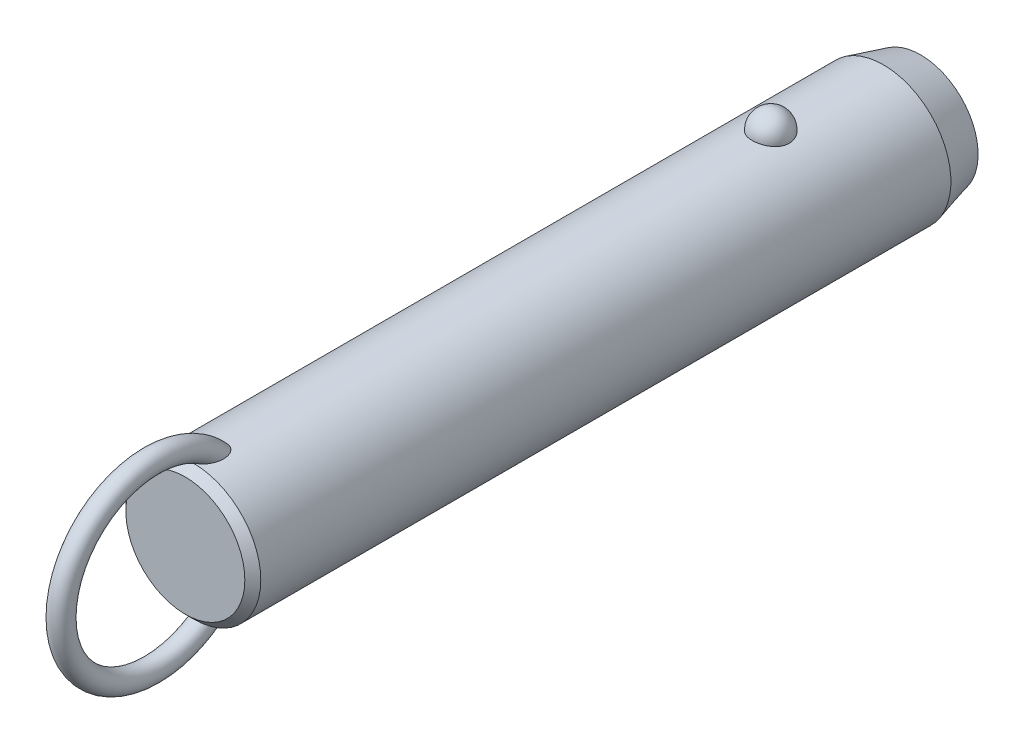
ISO-10303-21;
HEADER;
FILE_DESCRIPTION(('STEP AP214'),'2;1');
FILE_NAME('part.step','',(''),(''),'','','');
FILE_SCHEMA(('AUTOMOTIVE_DESIGN { 1 0 10303 214 1 1 1 1 }'));
ENDSEC;
DATA;
#1=APPLICATION_CONTEXT('core data for automotive mechanical design processes');
#2=APPLICATION_PROTOCOL_DEFINITION('international standard','automotive_design',2000,#1);
#3=PRODUCT_CONTEXT('',#1,'mechanical');
#4=PRODUCT('Part','Part','',(#3));
#5=PRODUCT_RELATED_PRODUCT_CATEGORY('part','',(#4));
#6=PRODUCT_DEFINITION_FORMATION('','',#4);
#7=PRODUCT_DEFINITION_CONTEXT('part definition',#1,'design');
#8=PRODUCT_DEFINITION('design','',#6,#7);
#9=PRODUCT_DEFINITION_SHAPE('','',#8);
#10=(LENGTH_UNIT() NAMED_UNIT(*) SI_UNIT(.MILLI.,.METRE.));
#11=(NAMED_UNIT(*) PLANE_ANGLE_UNIT() SI_UNIT($,.RADIAN.));
#12=(NAMED_UNIT(*) SI_UNIT($,.STERADIAN.) SOLID_ANGLE_UNIT());
#13=UNCERTAINTY_MEASURE_WITH_UNIT(LENGTH_MEASURE(1.E-05),#10,'distance_accuracy_value','');
#14=(GEOMETRIC_REPRESENTATION_CONTEXT(3) GLOBAL_UNCERTAINTY_ASSIGNED_CONTEXT((#13)) GLOBAL_UNIT_ASSIGNED_CONTEXT((#10,
#11,#12)) REPRESENTATION_CONTEXT('',''));
#15=CARTESIAN_POINT('',(0.,0.,0.));
#16=DIRECTION('',(0.,0.,1.));
#17=DIRECTION('',(1.,0.,0.));
#18=AXIS2_PLACEMENT_3D('',#15,#16,#17);
#19=CARTESIAN_POINT('',(0.,0.,94.));
#20=DIRECTION('',(0.,0.,-1.));
#21=DIRECTION('',(-1.,0.,0.));
#22=AXIS2_PLACEMENT_3D('',#19,#20,#21);
#23=CYLINDRICAL_SURFACE('',#22,12.7);
#24=CARTESIAN_POINT('',(3.46661256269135,12.2177165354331,-3.5));
#25=CARTESIAN_POINT('',(3.4666090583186,12.2177194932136,-3.30432790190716));
#26=CARTESIAN_POINT('',(3.45063567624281,12.2222841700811,-3.10861112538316));
#27=CARTESIAN_POINT('',(3.38712451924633,12.2400345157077,-2.72271899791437));
#28=CARTESIAN_POINT('',(3.33957415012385,12.2532236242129,-2.53254588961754));
#29=CARTESIAN_POINT('',(3.2141234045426,12.286724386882,-2.16324948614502));
#30=CARTESIAN_POINT('',(3.13623639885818,12.3070329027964,-1.98412136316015));
#31=CARTESIAN_POINT('',(2.95205930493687,12.3525018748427,-1.64180592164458));
#32=CARTESIAN_POINT('',(2.84577003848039,12.3776621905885,-1.47861814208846));
#33=CARTESIAN_POINT('',(2.60688050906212,12.4301712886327,-1.17190583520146));
#34=CARTESIAN_POINT('',(2.47415697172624,12.4575299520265,-1.02847897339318));
#35=CARTESIAN_POINT('',(2.18615174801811,12.5112810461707,-0.766177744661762));
#36=CARTESIAN_POINT('',(2.03087002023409,12.5376734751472,-0.64730342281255));
#37=CARTESIAN_POINT('',(1.70237334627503,12.5864761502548,-0.437732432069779));
#38=CARTESIAN_POINT('',(1.52920948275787,12.6088972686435,-0.346958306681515));
#39=CARTESIAN_POINT('',(1.16944170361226,12.6473352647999,-0.195750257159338));
#40=CARTESIAN_POINT('',(0.982839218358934,12.663352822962,-0.135313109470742));
#41=CARTESIAN_POINT('',(0.604961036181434,12.6869706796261,-0.0473241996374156));
#42=CARTESIAN_POINT('',(0.41382314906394,12.6947125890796,-0.0192185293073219));
#43=CARTESIAN_POINT('',(0.0293827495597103,12.7014203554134,0.0051725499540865));
#44=CARTESIAN_POINT('',(-0.163919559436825,12.7003870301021,0.00146092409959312));
#45=CARTESIAN_POINT('',(-0.544374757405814,12.689735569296,-0.0373939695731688));
#46=CARTESIAN_POINT('',(-0.731575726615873,12.6802364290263,-0.0721015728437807));
#47=CARTESIAN_POINT('',(-1.09733277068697,12.6538333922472,-0.171364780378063));
#48=CARTESIAN_POINT('',(-1.27588869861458,12.6369293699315,-0.235920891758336));
#49=CARTESIAN_POINT('',(-1.6204698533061,12.5973946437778,-0.393548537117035));
#50=CARTESIAN_POINT('',(-1.78641865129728,12.5747321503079,-0.486778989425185));
#51=CARTESIAN_POINT('',(-2.10030671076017,12.5261316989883,-0.699110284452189));
#52=CARTESIAN_POINT('',(-2.24824419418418,12.5001934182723,-0.818213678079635));
#53=CARTESIAN_POINT('',(-2.52491489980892,12.4472906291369,-1.08157124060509));
#54=CARTESIAN_POINT('',(-2.65324222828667,12.4203160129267,-1.22624992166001));
#55=CARTESIAN_POINT('',(-2.88410007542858,12.3687509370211,-1.53528325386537));
#56=CARTESIAN_POINT('',(-2.98662883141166,12.3441606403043,-1.69963924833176));
#57=CARTESIAN_POINT('',(-3.16432417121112,12.2998199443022,-2.04548497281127));
#58=CARTESIAN_POINT('',(-3.23917525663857,12.2801261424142,-2.22714424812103));
#59=CARTESIAN_POINT('',(-3.35800573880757,12.248167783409,-2.6009138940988));
#60=CARTESIAN_POINT('',(-3.4019860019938,12.2359030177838,-2.79302397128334));
#61=CARTESIAN_POINT('',(-3.45784812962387,12.2202347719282,-3.18140279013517));
#62=CARTESIAN_POINT('',(-3.46986123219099,12.2167950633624,-3.37765118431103));
#63=CARTESIAN_POINT('',(-3.46186273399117,12.2190638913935,-3.76943689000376));
#64=CARTESIAN_POINT('',(-3.44185196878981,12.2247721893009,-3.96497421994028));
#65=CARTESIAN_POINT('',(-3.37048652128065,12.2446381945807,-4.34881728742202));
#66=CARTESIAN_POINT('',(-3.31928253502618,12.2587552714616,-4.53715319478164));
#67=CARTESIAN_POINT('',(-3.18693461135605,12.2938237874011,-4.90231727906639));
#68=CARTESIAN_POINT('',(-3.1057895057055,12.3147754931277,-5.07914500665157));
#69=CARTESIAN_POINT('',(-2.91506431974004,12.3613125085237,-5.41732059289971));
#70=CARTESIAN_POINT('',(-2.80533587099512,12.3869217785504,-5.57858147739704));
#71=CARTESIAN_POINT('',(-2.560414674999,12.4398525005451,-5.88013283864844));
#72=CARTESIAN_POINT('',(-2.42522099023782,12.4671740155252,-6.02042254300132));
#73=CARTESIAN_POINT('',(-2.1323357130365,12.5205965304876,-6.27662798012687));
#74=CARTESIAN_POINT('',(-1.97456596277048,12.5466928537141,-6.3924554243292));
#75=CARTESIAN_POINT('',(-1.64115839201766,12.5946384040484,-6.59583547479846));
#76=CARTESIAN_POINT('',(-1.46552179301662,12.6164879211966,-6.68339001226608));
#77=CARTESIAN_POINT('',(-1.10356050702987,12.6532533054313,-6.82682153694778));
#78=CARTESIAN_POINT('',(-0.9173913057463,12.6682500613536,-6.8830698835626));
#79=CARTESIAN_POINT('',(-0.537836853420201,12.6900288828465,-6.96386887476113));
#80=CARTESIAN_POINT('',(-0.344452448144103,12.6968119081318,-6.9884232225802));
#81=CARTESIAN_POINT('',(0.0402577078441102,12.7013667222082,-7.00496469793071));
#82=CARTESIAN_POINT('',(0.231556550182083,12.6993008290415,-6.99753844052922));
#83=CARTESIAN_POINT('',(0.610105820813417,12.6867505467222,-6.9516636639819));
#84=CARTESIAN_POINT('',(0.797356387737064,12.6762664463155,-6.913216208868));
#85=CARTESIAN_POINT('',(1.16186657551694,12.6480587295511,-6.80658431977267));
#86=CARTESIAN_POINT('',(1.33915951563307,12.6303611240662,-6.73850666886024));
#87=CARTESIAN_POINT('',(1.67968518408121,12.5896027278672,-6.5745087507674));
#88=CARTESIAN_POINT('',(1.84291705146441,12.5665416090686,-6.47858678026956));
#89=CARTESIAN_POINT('',(2.15340192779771,12.5171072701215,-6.25982455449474));
#90=CARTESIAN_POINT('',(2.30037831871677,12.4906895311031,-6.13660186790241));
#91=CARTESIAN_POINT('',(2.5717412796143,12.4376567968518,-5.86739587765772));
#92=CARTESIAN_POINT('',(2.69612388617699,12.4110417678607,-5.72140858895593));
#93=CARTESIAN_POINT('',(2.92107785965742,12.360051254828,-5.40794137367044));
#94=CARTESIAN_POINT('',(3.02121329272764,12.3357209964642,-5.24014110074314));
#95=CARTESIAN_POINT('',(3.19236291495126,12.2925446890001,-4.88969865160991));
#96=CARTESIAN_POINT('',(3.26338839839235,12.2736965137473,-4.70706226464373));
#97=CARTESIAN_POINT('',(3.36788038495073,12.245404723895,-4.35469510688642));
#98=CARTESIAN_POINT('',(3.40484026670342,12.2351018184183,-4.18605935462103));
#99=CARTESIAN_POINT('',(3.45420764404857,12.2212564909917,-3.84496058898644));
#100=CARTESIAN_POINT('',(3.46661565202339,12.2177139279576,-3.67249765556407));
#101=CARTESIAN_POINT('',(3.46661256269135,12.2177165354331,-3.5));
#102=B_SPLINE_CURVE_WITH_KNOTS('',3,(#24,#25,#26,#27,#28,#29,#30,#31,#32,#33,#34,#35,#36,#37,
#38,#39,#40,#41,#42,#43,#44,#45,#46,#47,#48,#49,#50,#51,#52,#53,#54,#55,#56,#57,#58,#59,#60,#61,
#62,#63,#64,#65,#66,#67,#68,#69,#70,#71,#72,#73,#74,#75,#76,#77,#78,#79,#80,#81,#82,#83,#84,#85,
#86,#87,#88,#89,#90,#91,#92,#93,#94,#95,#96,#97,#98,#99,#100,#101),.UNSPECIFIED.,.T.,.F.,(4,2,2,
2,2,2,2,2,2,2,2,2,2,2,2,2,2,2,2,2,2,2,2,2,2,2,2,2,2,2,2,2,2,2,2,2,2,2,4),(0.,0.586396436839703,
1.17302689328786,1.7593990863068,2.34575431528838,2.93491084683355,3.52406845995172,
4.11158733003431,4.69904375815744,5.2762784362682,5.85345931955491,6.42265312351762,
6.99185659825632,7.56427334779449,8.136746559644,8.71981013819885,9.3029135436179,
9.89247258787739,10.4820150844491,11.0691335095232,11.6562366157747,12.2405256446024,
12.8248374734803,13.412244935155,13.9996740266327,14.5891883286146,15.1786623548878,
15.7609861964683,16.3432419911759,16.9148635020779,17.4864654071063,18.0560241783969,
18.6256177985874,19.2037609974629,19.7820055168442,20.3699810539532,20.957728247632,
21.4746855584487,21.9916320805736),.UNSPECIFIED.);
#103=CARTESIAN_POINT('',(3.46661256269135,12.2177165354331,-3.5));
#104=VERTEX_POINT('',#103);
#105=EDGE_CURVE('E41',#104,#104,#102,.T.);
#106=ORIENTED_EDGE('',*,*,#105,.T.);
#107=EDGE_LOOP('',(#106));
#108=FACE_BOUND('',#107,.T.);
#109=CARTESIAN_POINT('',(0.,0.,105.2));
#110=DIRECTION('',(0.,0.,1.));
#111=DIRECTION('',(1.,0.,0.));
#112=AXIS2_PLACEMENT_3D('',#109,#110,#111);
#113=CIRCLE('',#112,12.7);
#114=CARTESIAN_POINT('',(12.7,0.,105.2));
#115=VERTEX_POINT('',#114);
#116=EDGE_CURVE('E10',#115,#115,#113,.F.);
#117=ORIENTED_EDGE('',*,*,#116,.T.);
#118=EDGE_LOOP('',(#117));
#119=FACE_BOUND('',#118,.T.);
#120=CARTESIAN_POINT('',(-0.548122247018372,-12.6881662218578,98.9432187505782));
#121=CARTESIAN_POINT('',(-0.648865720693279,-12.6838128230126,98.977926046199));
#122=CARTESIAN_POINT('',(-0.746398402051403,-12.6783867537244,99.0220428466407));
#123=CARTESIAN_POINT('',(-0.93212506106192,-12.666091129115,99.1267647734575));
#124=CARTESIAN_POINT('',(-1.02030388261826,-12.6592192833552,99.187396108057));
#125=CARTESIAN_POINT('',(-1.18487740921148,-12.6448747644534,99.321847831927));
#126=CARTESIAN_POINT('',(-1.26134296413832,-12.637406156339,99.3955825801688));
#127=CARTESIAN_POINT('',(-1.40231200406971,-12.6225412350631,99.5536045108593));
#128=CARTESIAN_POINT('',(-1.46681470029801,-12.6151449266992,99.6378923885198));
#129=CARTESIAN_POINT('',(-1.60714786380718,-12.5981718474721,99.8496577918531));
#130=CARTESIAN_POINT('',(-1.67725126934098,-12.588900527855,99.980962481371));
#131=CARTESIAN_POINT('',(-1.79536591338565,-12.5725964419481,100.253247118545));
#132=CARTESIAN_POINT('',(-1.84333535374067,-12.5655679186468,100.394244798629));
#133=CARTESIAN_POINT('',(-1.93422576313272,-12.5519624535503,100.737645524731));
#134=CARTESIAN_POINT('',(-1.96788773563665,-12.5466298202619,100.942557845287));
#135=CARTESIAN_POINT('',(-1.9941399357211,-12.542463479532,101.251760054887));
#136=CARTESIAN_POINT('',(-1.99883864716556,-12.5417153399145,101.355298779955));
#137=CARTESIAN_POINT('',(-2.00078003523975,-12.5414074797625,101.56245124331));
#138=CARTESIAN_POINT('',(-1.99802449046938,-12.5418474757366,101.666064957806));
#139=CARTESIAN_POINT('',(-1.98336733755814,-12.5441750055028,101.910320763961));
#140=CARTESIAN_POINT('',(-1.96851430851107,-12.5465291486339,102.050780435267));
#141=CARTESIAN_POINT('',(-1.92707089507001,-12.5529612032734,102.329960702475));
#142=CARTESIAN_POINT('',(-1.90047458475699,-12.5570399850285,102.468680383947));
#143=CARTESIAN_POINT('',(-1.83619120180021,-12.5666008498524,102.74341135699));
#144=CARTESIAN_POINT('',(-1.79850828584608,-12.57208240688,102.879423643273));
#145=CARTESIAN_POINT('',(-1.71223796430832,-12.5841228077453,103.147842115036));
#146=CARTESIAN_POINT('',(-1.66365679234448,-12.5906810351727,103.280250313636));
#147=CARTESIAN_POINT('',(-1.5780450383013,-12.6016176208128,103.48548877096));
#148=CARTESIAN_POINT('',(-1.54477252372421,-12.6057501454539,103.559914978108));
#149=CARTESIAN_POINT('',(-1.47424480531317,-12.6141930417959,103.706839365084));
#150=CARTESIAN_POINT('',(-1.43699041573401,-12.6185033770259,103.779337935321));
#151=CARTESIAN_POINT('',(-1.35825795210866,-12.6272207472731,103.921892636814));
#152=CARTESIAN_POINT('',(-1.31678520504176,-12.6316276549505,103.991951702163));
#153=CARTESIAN_POINT('',(-1.22917793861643,-12.6404532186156,104.129070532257));
#154=CARTESIAN_POINT('',(-1.18304514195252,-12.6448718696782,104.196131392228));
#155=CARTESIAN_POINT('',(-1.07246411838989,-12.6547893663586,104.343874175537));
#156=CARTESIAN_POINT('',(-1.00642239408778,-12.6602600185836,104.423384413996));
#157=CARTESIAN_POINT('',(-0.864441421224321,-12.6707460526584,104.573169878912));
#158=CARTESIAN_POINT('',(-0.788516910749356,-12.6757620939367,104.643458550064));
#159=CARTESIAN_POINT('',(-0.652215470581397,-12.6833591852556,104.748680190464));
#160=CARTESIAN_POINT('',(-0.594982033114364,-12.6861973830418,104.787624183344));
#161=CARTESIAN_POINT('',(-0.475269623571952,-12.6912445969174,104.856489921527));
#162=CARTESIAN_POINT('',(-0.412800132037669,-12.6934547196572,104.886427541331));
#163=CARTESIAN_POINT('',(-0.295749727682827,-12.6966636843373,104.929756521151));
#164=CARTESIAN_POINT('',(-0.241949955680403,-12.6978134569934,104.945218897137));
#165=CARTESIAN_POINT('',(-0.132508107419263,-12.6994261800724,104.966884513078));
#166=CARTESIAN_POINT('',(-0.0768679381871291,-12.6998898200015,104.973097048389));
#167=CARTESIAN_POINT('',(0.0347696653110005,-12.7000752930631,104.975583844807));
#168=CARTESIAN_POINT('',(0.0907676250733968,-12.6997954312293,104.971835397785));
#169=CARTESIAN_POINT('',(0.20128301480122,-12.6985255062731,104.954788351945));
#170=CARTESIAN_POINT('',(0.255799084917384,-12.6975348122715,104.941481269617));
#171=CARTESIAN_POINT('',(0.376042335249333,-12.6946091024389,104.90203792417));
#172=CARTESIAN_POINT('',(0.44095085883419,-12.6924943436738,104.873449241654));
#173=CARTESIAN_POINT('',(0.565350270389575,-12.6875639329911,104.806323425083));
#174=CARTESIAN_POINT('',(0.624828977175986,-12.6847467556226,104.767764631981));
#175=CARTESIAN_POINT('',(0.774116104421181,-12.6767252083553,104.656949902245));
#176=CARTESIAN_POINT('',(0.859449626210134,-12.6711344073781,104.578760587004));
#177=CARTESIAN_POINT('',(1.01789440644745,-12.6593922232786,104.410943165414));
#178=CARTESIAN_POINT('',(1.09096902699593,-12.653239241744,104.321282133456));
#179=CARTESIAN_POINT('',(1.22268793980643,-12.6411674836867,104.140265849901));
#180=CARTESIAN_POINT('',(1.28193986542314,-12.6352572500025,104.049345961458));
#181=CARTESIAN_POINT('',(1.39259777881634,-12.6235401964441,103.862792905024));
#182=CARTESIAN_POINT('',(1.44399707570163,-12.6177334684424,103.767155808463));
#183=CARTESIAN_POINT('',(1.53972870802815,-12.6064093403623,103.572273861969));
#184=CARTESIAN_POINT('',(1.58405262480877,-12.6008922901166,103.473024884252));
#185=CARTESIAN_POINT('',(1.66600705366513,-12.5903187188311,103.271772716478));
#186=CARTESIAN_POINT('',(1.70363651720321,-12.5852622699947,103.169769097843));
#187=CARTESIAN_POINT('',(1.77545379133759,-12.5753406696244,102.954358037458));
#188=CARTESIAN_POINT('',(1.80903453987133,-12.5705328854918,102.840745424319));
#189=CARTESIAN_POINT('',(1.86844163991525,-12.5618400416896,102.611457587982));
#190=CARTESIAN_POINT('',(1.89426665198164,-12.5579551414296,102.495782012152));
#191=CARTESIAN_POINT('',(1.9378546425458,-12.5513030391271,102.263007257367));
#192=CARTESIAN_POINT('',(1.9556264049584,-12.5485346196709,102.145909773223));
#193=CARTESIAN_POINT('',(1.98264463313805,-12.5442934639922,101.910747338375));
#194=CARTESIAN_POINT('',(1.99189298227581,-12.5428204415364,101.79268260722));
#195=CARTESIAN_POINT('',(2.00416068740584,-12.540871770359,101.480622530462));
#196=CARTESIAN_POINT('',(1.99944433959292,-12.541631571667,101.286229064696));
#197=CARTESIAN_POINT('',(1.96113755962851,-12.5476846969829,100.900309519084));
#198=CARTESIAN_POINT('',(1.92758341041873,-12.5529723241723,100.708780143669));
#199=CARTESIAN_POINT('',(1.83934342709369,-12.5661532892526,100.382272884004));
#200=CARTESIAN_POINT('',(1.79215440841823,-12.5730485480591,100.24524997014));
#201=CARTESIAN_POINT('',(1.67676242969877,-12.588958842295,99.9804459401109));
#202=CARTESIAN_POINT('',(1.60859050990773,-12.597970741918,99.8526515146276));
#203=CARTESIAN_POINT('',(1.46583832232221,-12.6152829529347,99.6358006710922));
#204=CARTESIAN_POINT('',(1.39525727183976,-12.6233659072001,99.5441050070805));
#205=CARTESIAN_POINT('',(1.23992594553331,-12.6395676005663,99.3734854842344));
#206=CARTESIAN_POINT('',(1.1551793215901,-12.6476863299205,99.2945583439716));
#207=CARTESIAN_POINT('',(0.971995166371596,-12.6630846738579,99.1526438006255));
#208=CARTESIAN_POINT('',(0.873456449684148,-12.6703572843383,99.0897849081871));
#209=CARTESIAN_POINT('',(0.665847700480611,-12.6829569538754,98.9844870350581));
#210=CARTESIAN_POINT('',(0.556784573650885,-12.688285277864,98.9420347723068));
#211=CARTESIAN_POINT('',(0.347338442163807,-12.6956226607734,98.8844434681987));
#212=CARTESIAN_POINT('',(0.247759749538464,-12.6979816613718,98.8663996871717));
#213=CARTESIAN_POINT('',(0.0470218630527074,-12.7003077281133,98.848600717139));
#214=CARTESIAN_POINT('',(-0.0541350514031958,-12.7002779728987,98.8488212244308));
#215=CARTESIAN_POINT('',(-0.221414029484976,-12.6982482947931,98.8643639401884));
#216=CARTESIAN_POINT('',(-0.288055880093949,-12.6969033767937,98.8746662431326));
#217=CARTESIAN_POINT('',(-0.419599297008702,-12.6932369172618,98.9031348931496));
#218=CARTESIAN_POINT('',(-0.484501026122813,-12.6909154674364,98.9213005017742));
#219=CARTESIAN_POINT('',(-0.548122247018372,-12.6881662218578,98.9432187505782));
#220=B_SPLINE_CURVE_WITH_KNOTS('',3,(#120,#121,#122,#123,#124,#125,#126,#127,#128,#129,#130,
#131,#132,#133,#134,#135,#136,#137,#138,#139,#140,#141,#142,#143,#144,#145,#146,#147,#148,#149,
#150,#151,#152,#153,#154,#155,#156,#157,#158,#159,#160,#161,#162,#163,#164,#165,#166,#167,#168,
#169,#170,#171,#172,#173,#174,#175,#176,#177,#178,#179,#180,#181,#182,#183,#184,#185,#186,#187,
#188,#189,#190,#191,#192,#193,#194,#195,#196,#197,#198,#199,#200,#201,#202,#203,#204,#205,#206,
#207,#208,#209,#210,#211,#212,#213,#214,#215,#216,#217,#218,#219),.UNSPECIFIED.,.T.,.F.,(4,2,2,
2,2,2,2,2,2,2,2,2,2,2,2,2,2,2,2,2,2,2,2,2,2,2,2,2,2,2,2,2,2,2,2,2,2,2,2,2,2,2,2,2,2,2,2,2,2,4),
(0.,0.31964225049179,0.639794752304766,0.957927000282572,1.27608021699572,1.72100165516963,
2.16675988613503,2.78630021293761,3.09705782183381,3.40774128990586,3.83096358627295,
4.2543996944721,4.67767724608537,5.10071330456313,5.34550297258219,5.59024267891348,
5.83467707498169,6.07902143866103,6.38891080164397,6.69834321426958,6.90560910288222,
7.11250749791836,7.27977315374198,7.44687060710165,7.61434932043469,7.78197685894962,
7.99365544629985,8.20579780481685,8.55147335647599,8.89816429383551,9.22375138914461,
9.5496143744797,9.87586224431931,10.202161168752,10.557587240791,10.9130746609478,
11.2681734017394,11.6231936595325,12.2046601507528,12.7853961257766,13.219164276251,
13.6522938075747,13.9989174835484,14.3454519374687,14.6946768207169,15.0436740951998,
15.3457513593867,15.6474266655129,15.8493051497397,16.0511646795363),.UNSPECIFIED.);
#221=CARTESIAN_POINT('',(-0.548122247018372,-12.6881662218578,98.9432187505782));
#222=VERTEX_POINT('',#221);
#223=EDGE_CURVE('E60',#222,#222,#220,.T.);
#224=ORIENTED_EDGE('',*,*,#223,.T.);
#225=EDGE_LOOP('',(#224));
#226=FACE_BOUND('',#225,.T.);
#227=CARTESIAN_POINT('',(-0.548122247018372,12.6881662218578,98.9432187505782));
#228=CARTESIAN_POINT('',(-0.459436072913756,12.6919968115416,98.912673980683));
#229=CARTESIAN_POINT('',(-0.368189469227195,12.6949996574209,98.8893913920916));
#230=CARTESIAN_POINT('',(-0.183024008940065,12.6990186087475,98.8584062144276));
#231=CARTESIAN_POINT('',(-0.0891049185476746,12.7000345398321,98.8507049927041));
#232=CARTESIAN_POINT('',(0.0987147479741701,12.6999636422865,98.8512455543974));
#233=CARTESIAN_POINT('',(0.192615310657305,12.6988761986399,98.8594920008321));
#234=CARTESIAN_POINT('',(0.377658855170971,12.6947211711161,98.8915515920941));
#235=CARTESIAN_POINT('',(0.468801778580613,12.6916535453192,98.9153650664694));
#236=CARTESIAN_POINT('',(0.645809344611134,12.6838788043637,98.9774565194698));
#237=CARTESIAN_POINT('',(0.731679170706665,12.6791733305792,99.015720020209));
#238=CARTESIAN_POINT('',(0.896315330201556,12.6686004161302,99.105120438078));
#239=CARTESIAN_POINT('',(0.975080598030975,12.6627328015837,99.1562592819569));
#240=CARTESIAN_POINT('',(1.12963655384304,12.6499161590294,99.2736782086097));
#241=CARTESIAN_POINT('',(1.20478673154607,12.6429194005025,99.3407929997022));
#242=CARTESIAN_POINT('',(1.34448241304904,12.6288282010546,99.4852250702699));
#243=CARTESIAN_POINT('',(1.40902173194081,12.621733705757,99.5625482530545));
#244=CARTESIAN_POINT('',(1.55208211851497,12.6050877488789,99.7592475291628));
#245=CARTESIAN_POINT('',(1.62510490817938,12.5957546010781,99.8826540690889));
#246=CARTESIAN_POINT('',(1.75019044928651,12.5789823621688,100.139769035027));
#247=CARTESIAN_POINT('',(1.80221377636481,12.5715468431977,100.273496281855));
#248=CARTESIAN_POINT('',(1.90309965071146,12.5567434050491,100.598351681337));
#249=CARTESIAN_POINT('',(1.94342317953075,12.5504515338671,100.792161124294));
#250=CARTESIAN_POINT('',(1.99332997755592,12.5426147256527,101.18378810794));
#251=CARTESIAN_POINT('',(2.00285305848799,12.5410790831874,101.381612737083));
#252=CARTESIAN_POINT('',(1.99678999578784,12.5420407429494,101.716642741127));
#253=CARTESIAN_POINT('',(1.98794117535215,12.5434564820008,101.854042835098));
#254=CARTESIAN_POINT('',(1.95865119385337,12.5480641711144,102.127639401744));
#255=CARTESIAN_POINT('',(1.93820436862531,12.5512569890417,102.263835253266));
#256=CARTESIAN_POINT('',(1.88647896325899,12.5591352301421,102.534249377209));
#257=CARTESIAN_POINT('',(1.85518800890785,12.5638223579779,102.668465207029));
#258=CARTESIAN_POINT('',(1.78217886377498,12.5743868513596,102.933936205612));
#259=CARTESIAN_POINT('',(1.74046509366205,12.5802637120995,103.065192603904));
#260=CARTESIAN_POINT('',(1.66024095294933,12.5910571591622,103.286085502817));
#261=CARTESIAN_POINT('',(1.62434772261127,12.5957535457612,103.376690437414));
#262=CARTESIAN_POINT('',(1.5470900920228,12.6054762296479,103.555512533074));
#263=CARTESIAN_POINT('',(1.50572681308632,12.6105024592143,103.643730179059));
#264=CARTESIAN_POINT('',(1.41728020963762,12.620748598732,103.816932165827));
#265=CARTESIAN_POINT('',(1.37021377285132,12.625967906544,103.901925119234));
#266=CARTESIAN_POINT('',(1.2696962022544,12.6364721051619,104.068007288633));
#267=CARTESIAN_POINT('',(1.21624929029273,12.6417569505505,104.149099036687));
#268=CARTESIAN_POINT('',(1.10304413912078,12.6521331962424,104.304702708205));
#269=CARTESIAN_POINT('',(1.04340936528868,12.657226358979,104.379303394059));
#270=CARTESIAN_POINT('',(0.91591933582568,12.6670906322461,104.521324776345));
#271=CARTESIAN_POINT('',(0.84806456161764,12.6718617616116,104.58874589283));
#272=CARTESIAN_POINT('',(0.717035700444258,12.67987711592,104.700624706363));
#273=CARTESIAN_POINT('',(0.655526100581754,12.6832377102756,104.746997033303));
#274=CARTESIAN_POINT('',(0.525985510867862,12.6892676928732,104.829619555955));
#275=CARTESIAN_POINT('',(0.45796984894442,12.6919386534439,104.865892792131));
#276=CARTESIAN_POINT('',(0.334859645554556,12.695691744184,104.916657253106));
#277=CARTESIAN_POINT('',(0.281116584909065,12.6970073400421,104.934373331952));
#278=CARTESIAN_POINT('',(0.171425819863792,12.6989609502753,104.960642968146));
#279=CARTESIAN_POINT('',(0.11548082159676,12.699599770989,104.969207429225));
#280=CARTESIAN_POINT('',(0.00272618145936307,12.7001251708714,104.976253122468));
#281=CARTESIAN_POINT('',(-0.0540859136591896,12.7000089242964,104.974696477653));
#282=CARTESIAN_POINT('',(-0.166544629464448,12.6990328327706,104.961600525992));
#283=CARTESIAN_POINT('',(-0.222190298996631,12.6981724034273,104.950053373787));
#284=CARTESIAN_POINT('',(-0.342018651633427,12.695562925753,104.914912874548));
#285=CARTESIAN_POINT('',(-0.405606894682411,12.6936676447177,104.88933225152));
#286=CARTESIAN_POINT('',(-0.527815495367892,12.6891754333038,104.828311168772));
#287=CARTESIAN_POINT('',(-0.586425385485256,12.6865770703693,104.792850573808));
#288=CARTESIAN_POINT('',(-0.731842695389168,12.6792129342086,104.691496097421));
#289=CARTESIAN_POINT('',(-0.814709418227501,12.6740767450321,104.6200395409));
#290=CARTESIAN_POINT('',(-0.969101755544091,12.6632083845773,104.46589007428));
#291=CARTESIAN_POINT('',(-1.04059564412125,12.6574746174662,104.383166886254));
#292=CARTESIAN_POINT('',(-1.16981116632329,12.6461638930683,104.215809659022));
#293=CARTESIAN_POINT('',(-1.22811369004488,12.6405994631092,104.131616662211));
#294=CARTESIAN_POINT('',(-1.33743405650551,12.6295007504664,103.958579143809));
#295=CARTESIAN_POINT('',(-1.38844577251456,12.6239664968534,103.869730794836));
#296=CARTESIAN_POINT('',(-1.4840070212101,12.6130898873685,103.688389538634));
#297=CARTESIAN_POINT('',(-1.52854232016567,12.6077479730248,103.595889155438));
#298=CARTESIAN_POINT('',(-1.6115011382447,12.5974127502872,103.408160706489));
#299=CARTESIAN_POINT('',(-1.64992317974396,12.5924195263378,103.312931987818));
#300=CARTESIAN_POINT('',(-1.73468589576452,12.581070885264,103.08289362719));
#301=CARTESIAN_POINT('',(-1.77831261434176,12.5749388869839,102.947066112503));
#302=CARTESIAN_POINT('',(-1.85439734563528,12.5639437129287,102.672212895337));
#303=CARTESIAN_POINT('',(-1.88684994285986,12.5590811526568,102.533185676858));
#304=CARTESIAN_POINT('',(-1.94008483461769,12.550968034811,102.25309235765));
#305=CARTESIAN_POINT('',(-1.96088706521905,12.5477147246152,102.112030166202));
#306=CARTESIAN_POINT('',(-1.99000539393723,12.5431291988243,101.828668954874));
#307=CARTESIAN_POINT('',(-1.99832911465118,12.5417958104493,101.686370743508));
#308=CARTESIAN_POINT('',(-2.00166624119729,12.5412674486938,101.357627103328));
#309=CARTESIAN_POINT('',(-1.99178843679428,12.5428579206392,101.171088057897));
#310=CARTESIAN_POINT('',(-1.9445518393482,12.5502731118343,100.80162404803));
#311=CARTESIAN_POINT('',(-1.90724032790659,12.5560905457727,100.618693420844));
#312=CARTESIAN_POINT('',(-1.81330718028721,12.5699462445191,100.304848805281));
#313=CARTESIAN_POINT('',(-1.76338820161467,12.5771273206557,100.171910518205));
#314=CARTESIAN_POINT('',(-1.64305018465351,12.593414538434,99.9156813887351));
#315=CARTESIAN_POINT('',(-1.57265346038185,12.6025185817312,99.792380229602));
#316=CARTESIAN_POINT('',(-1.42634956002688,12.6198178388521,99.5835648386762));
#317=CARTESIAN_POINT('',(-1.35423772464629,12.6278405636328,99.4953846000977));
#318=CARTESIAN_POINT('',(-1.19645664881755,12.6437632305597,99.332107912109));
#319=CARTESIAN_POINT('',(-1.11080536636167,12.6516633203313,99.2569944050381));
#320=CARTESIAN_POINT('',(-0.947219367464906,12.6648319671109,99.1378114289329));
#321=CARTESIAN_POINT('',(-0.871624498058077,12.670300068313,99.0905414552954));
#322=CARTESIAN_POINT('',(-0.714161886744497,12.6801492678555,99.0077413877));
#323=CARTESIAN_POINT('',(-0.632295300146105,12.684530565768,98.9722091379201));
#324=CARTESIAN_POINT('',(-0.548122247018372,12.6881662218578,98.9432187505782));
#325=B_SPLINE_CURVE_WITH_KNOTS('',3,(#227,#228,#229,#230,#231,#232,#233,#234,#235,#236,#237,
#238,#239,#240,#241,#242,#243,#244,#245,#246,#247,#248,#249,#250,#251,#252,#253,#254,#255,#256,
#257,#258,#259,#260,#261,#262,#263,#264,#265,#266,#267,#268,#269,#270,#271,#272,#273,#274,#275,
#276,#277,#278,#279,#280,#281,#282,#283,#284,#285,#286,#287,#288,#289,#290,#291,#292,#293,#294,
#295,#296,#297,#298,#299,#300,#301,#302,#303,#304,#305,#306,#307,#308,#309,#310,#311,#312,#313,
#314,#315,#316,#317,#318,#319,#320,#321,#322,#323,#324),.UNSPECIFIED.,.T.,.F.,(4,2,2,2,2,2,2,2,
2,2,2,2,2,2,2,2,2,2,2,2,2,2,2,2,2,2,2,2,2,2,2,2,2,2,2,2,2,2,2,2,2,2,2,2,2,2,2,2,4),(0.,
0.281328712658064,0.562682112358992,0.844117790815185,1.12555942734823,1.40671982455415,
1.68792232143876,1.98972294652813,2.29169886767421,2.72039860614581,3.14989948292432,
3.74084916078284,4.33295293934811,4.74554109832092,5.15833092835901,5.57159335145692,
5.98468079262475,6.2772277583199,6.56971484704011,6.86135609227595,7.15280542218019,
7.43927407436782,7.72572595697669,7.95635862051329,8.18646071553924,8.35559393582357,
8.52452541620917,8.69408946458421,8.86378678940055,9.06834348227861,9.27332014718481,
9.60010414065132,9.92778432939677,10.2350252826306,10.5425229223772,10.8506864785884,
11.1589244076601,11.5867893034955,12.0148612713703,12.4421984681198,12.8692745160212,
13.4279365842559,13.9856380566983,14.4107062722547,14.8353130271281,15.1765567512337,
15.5173516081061,15.7844129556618,16.051425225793),.UNSPECIFIED.);
#326=CARTESIAN_POINT('',(-0.548122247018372,12.6881662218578,98.9432187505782));
#327=VERTEX_POINT('',#326);
#328=EDGE_CURVE('E67',#327,#327,#325,.T.);
#329=ORIENTED_EDGE('',*,*,#328,.T.);
#330=EDGE_LOOP('',(#329));
#331=FACE_BOUND('',#330,.T.);
#332=CARTESIAN_POINT('',(0.,0.,-24.6999999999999));
#333=DIRECTION('',(0.,0.,-1.));
#334=DIRECTION('',(-1.,0.,0.));
#335=AXIS2_PLACEMENT_3D('',#332,#333,#334);
#336=CIRCLE('',#335,12.7);
#337=CARTESIAN_POINT('',(-12.7,0.,-24.6999999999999));
#338=VERTEX_POINT('',#337);
#339=EDGE_CURVE('E57',#338,#338,#336,.F.);
#340=ORIENTED_EDGE('',*,*,#339,.T.);
#341=EDGE_LOOP('',(#340));
#342=FACE_BOUND('',#341,.T.);
#343=ADVANCED_FACE('F37',(#108,#119,#226,#331,#342),#23,.T.);
#344=CARTESIAN_POINT('',(0.,0.,-31.7));
#345=DIRECTION('',(0.,0.,-1.));
#346=DIRECTION('',(-1.,0.,0.));
#347=AXIS2_PLACEMENT_3D('',#344,#345,#346);
#348=PLANE('',#347);
#349=CARTESIAN_POINT('',(0.,0.,-31.7));
#350=DIRECTION('',(0.,0.,-1.));
#351=DIRECTION('',(-1.,0.,0.));
#352=AXIS2_PLACEMENT_3D('',#349,#350,#351);
#353=CIRCLE('',#352,10.8243556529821);
#354=CARTESIAN_POINT('',(-10.8243556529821,0.,-31.7));
#355=VERTEX_POINT('',#354);
#356=EDGE_CURVE('E66',#355,#355,#353,.T.);
#357=ORIENTED_EDGE('',*,*,#356,.T.);
#358=EDGE_LOOP('',(#357));
#359=FACE_BOUND('',#358,.T.);
#360=ADVANCED_FACE('F85',(#359),#348,.T.);
#361=CARTESIAN_POINT('',(0.,0.,-31.7));
#362=DIRECTION('',(0.,0.,1.));
#363=DIRECTION('',(1.,0.,0.));
#364=AXIS2_PLACEMENT_3D('',#361,#362,#363);
#365=CONICAL_SURFACE('',#364,10.8243556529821,0.261799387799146);
#366=ORIENTED_EDGE('',*,*,#339,.F.);
#367=EDGE_LOOP('',(#366));
#368=FACE_BOUND('',#367,.T.);
#369=ORIENTED_EDGE('',*,*,#356,.F.);
#370=EDGE_LOOP('',(#369));
#371=FACE_BOUND('',#370,.T.);
#372=ADVANCED_FACE('F83',(#368,#371),#365,.T.);
#373=CARTESIAN_POINT('',(0.,0.,106.7));
#374=DIRECTION('',(0.,0.,1.));
#375=DIRECTION('',(1.,0.,0.));
#376=AXIS2_PLACEMENT_3D('',#373,#374,#375);
#377=PLANE('',#376);
#378=CARTESIAN_POINT('',(0.,0.,106.7));
#379=DIRECTION('',(0.,0.,1.));
#380=DIRECTION('',(1.,0.,0.));
#381=AXIS2_PLACEMENT_3D('',#378,#379,#380);
#382=CIRCLE('',#381,11.2);
#383=CARTESIAN_POINT('',(11.2,0.,106.7));
#384=VERTEX_POINT('',#383);
#385=EDGE_CURVE('E50',#384,#384,#382,.T.);
#386=ORIENTED_EDGE('',*,*,#385,.T.);
#387=EDGE_LOOP('',(#386));
#388=FACE_BOUND('',#387,.T.);
#389=ADVANCED_FACE('F77',(#388),#377,.T.);
#390=CARTESIAN_POINT('',(0.,0.,113.05));
#391=DIRECTION('',(1.,0.,0.));
#392=DIRECTION('',(0.,0.,-1.));
#393=AXIS2_PLACEMENT_3D('',#390,#391,#392);
#394=TOROIDAL_SURFACE('',#393,17.05,2.);
#395=ORIENTED_EDGE('',*,*,#328,.F.);
#396=EDGE_LOOP('',(#395));
#397=FACE_BOUND('',#396,.T.);
#398=ORIENTED_EDGE('',*,*,#223,.F.);
#399=EDGE_LOOP('',(#398));
#400=FACE_BOUND('',#399,.T.);
#401=ADVANCED_FACE('F73',(#397,#400),#394,.T.);
#402=CARTESIAN_POINT('',(0.,0.,106.7));
#403=DIRECTION('',(0.,0.,-1.));
#404=DIRECTION('',(-1.,0.,0.));
#405=AXIS2_PLACEMENT_3D('',#402,#403,#404);
#406=CONICAL_SURFACE('',#405,11.2,0.785398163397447);
#407=ORIENTED_EDGE('',*,*,#116,.F.);
#408=EDGE_LOOP('',(#407));
#409=FACE_BOUND('',#408,.T.);
#410=ORIENTED_EDGE('',*,*,#385,.F.);
#411=EDGE_LOOP('',(#410));
#412=FACE_BOUND('',#411,.T.);
#413=ADVANCED_FACE('F39',(#409,#412),#406,.T.);
#414=CARTESIAN_POINT('',(0.,12.7,-3.5));
#415=DIRECTION('',(0.,1.,0.));
#416=DIRECTION('',(0.,0.,-1.));
#417=AXIS2_PLACEMENT_3D('',#414,#415,#416);
#418=SPHERICAL_SURFACE('',#417,3.5);
#419=ORIENTED_EDGE('',*,*,#105,.F.);
#420=EDGE_LOOP('',(#419));
#421=FACE_BOUND('',#420,.T.);
#422=ADVANCED_FACE('F79',(#421),#418,.T.);
#423=CLOSED_SHELL('',(#343,#360,#372,#389,#401,#413,#422));
#424=MANIFOLD_SOLID_BREP('B2',#423);
#425=ADVANCED_BREP_SHAPE_REPRESENTATION('',(#18,#424),#14);
#426=SHAPE_DEFINITION_REPRESENTATION(#9,#425);
ENDSEC;
END-ISO-10303-21;
